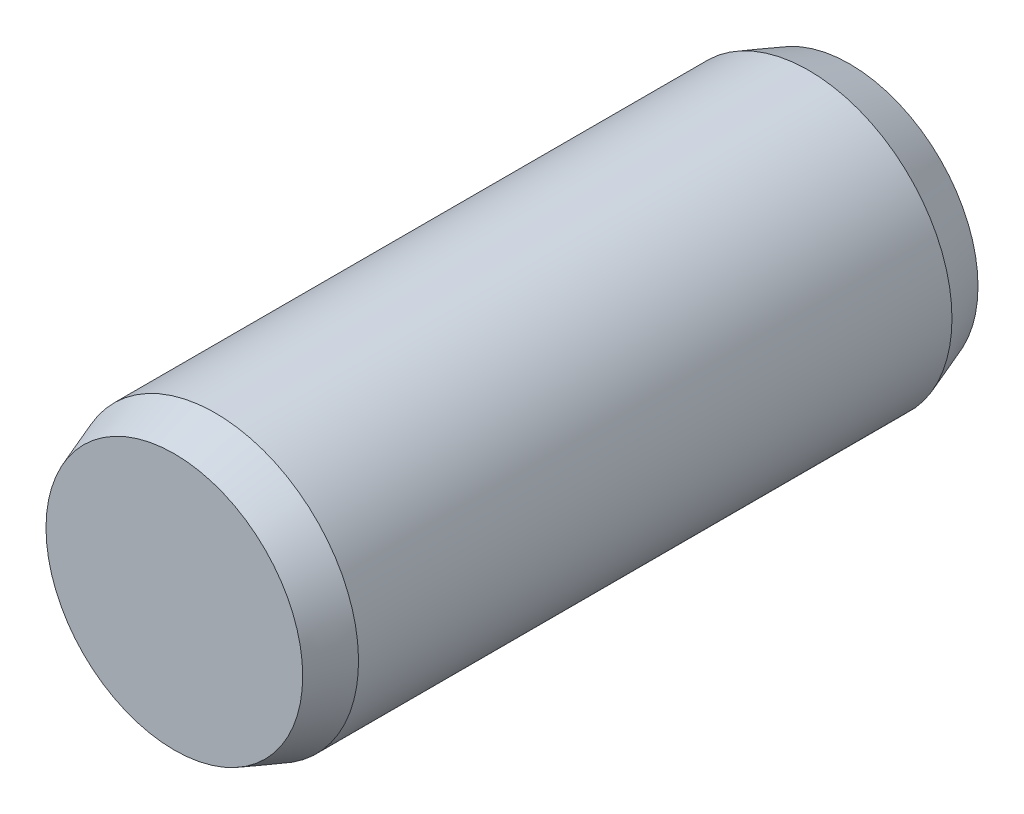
ISO-10303-21;
HEADER;
FILE_DESCRIPTION(('STEP AP214'),'2;1');
FILE_NAME('part.step','',(''),(''),'','','');
FILE_SCHEMA(('AUTOMOTIVE_DESIGN { 1 0 10303 214 1 1 1 1 }'));
ENDSEC;
DATA;
#1=APPLICATION_CONTEXT('core data for automotive mechanical design processes');
#2=APPLICATION_PROTOCOL_DEFINITION('international standard','automotive_design',2000,#1);
#3=PRODUCT_CONTEXT('',#1,'mechanical');
#4=PRODUCT('Part','Part','',(#3));
#5=PRODUCT_RELATED_PRODUCT_CATEGORY('part','',(#4));
#6=PRODUCT_DEFINITION_FORMATION('','',#4);
#7=PRODUCT_DEFINITION_CONTEXT('part definition',#1,'design');
#8=PRODUCT_DEFINITION('design','',#6,#7);
#9=PRODUCT_DEFINITION_SHAPE('','',#8);
#10=(LENGTH_UNIT() NAMED_UNIT(*) SI_UNIT(.MILLI.,.METRE.));
#11=(NAMED_UNIT(*) PLANE_ANGLE_UNIT() SI_UNIT($,.RADIAN.));
#12=(NAMED_UNIT(*) SI_UNIT($,.STERADIAN.) SOLID_ANGLE_UNIT());
#13=UNCERTAINTY_MEASURE_WITH_UNIT(LENGTH_MEASURE(1.E-05),#10,'distance_accuracy_value','');
#14=(GEOMETRIC_REPRESENTATION_CONTEXT(3) GLOBAL_UNCERTAINTY_ASSIGNED_CONTEXT((#13)) GLOBAL_UNIT_ASSIGNED_CONTEXT((#10,
#11,#12)) REPRESENTATION_CONTEXT('',''));
#15=CARTESIAN_POINT('',(0.,0.,0.));
#16=DIRECTION('',(0.,0.,1.));
#17=DIRECTION('',(1.,0.,0.));
#18=AXIS2_PLACEMENT_3D('',#15,#16,#17);
#19=CARTESIAN_POINT('',(0.,0.,7.9));
#20=DIRECTION('',(0.,0.,1.));
#21=DIRECTION('',(1.,0.,0.));
#22=AXIS2_PLACEMENT_3D('',#19,#20,#21);
#23=PLANE('',#22);
#24=CARTESIAN_POINT('',(-137.6913613,22.06128547,7.89999997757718));
#25=DIRECTION('',(0.,0.,-1.));
#26=DIRECTION('',(-1.,0.,0.));
#27=AXIS2_PLACEMENT_3D('',#24,#25,#26);
#28=CIRCLE('',#27,3.1360297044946);
#29=CARTESIAN_POINT('',(-140.827391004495,22.06128547,7.89999997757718));
#30=VERTEX_POINT('',#29);
#31=EDGE_CURVE('E17',#30,#30,#28,.F.);
#32=ORIENTED_EDGE('',*,*,#31,.T.);
#33=EDGE_LOOP('',(#32));
#34=FACE_BOUND('',#33,.T.);
#35=ADVANCED_FACE('F14',(#34),#23,.T.);
#36=CARTESIAN_POINT('',(0.,0.,-8.6));
#37=DIRECTION('',(0.,0.,-1.));
#38=DIRECTION('',(-1.,0.,0.));
#39=AXIS2_PLACEMENT_3D('',#36,#37,#38);
#40=PLANE('',#39);
#41=CARTESIAN_POINT('',(-137.6913613,22.06128547,-8.60000000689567));
#42=DIRECTION('',(0.,0.,1.));
#43=DIRECTION('',(1.,0.,0.));
#44=AXIS2_PLACEMENT_3D('',#41,#42,#43);
#45=CIRCLE('',#44,3.13602978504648);
#46=CARTESIAN_POINT('',(-134.555331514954,22.06128547,-8.60000000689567));
#47=VERTEX_POINT('',#46);
#48=EDGE_CURVE('E26',#47,#47,#45,.F.);
#49=ORIENTED_EDGE('',*,*,#48,.T.);
#50=EDGE_LOOP('',(#49));
#51=FACE_BOUND('',#50,.T.);
#52=ADVANCED_FACE('F38',(#51),#40,.T.);
#53=CARTESIAN_POINT('',(-137.6913613,22.06128547,7.9));
#54=DIRECTION('',(0.,0.,-1.));
#55=DIRECTION('',(-1.,0.,0.));
#56=AXIS2_PLACEMENT_3D('',#53,#54,#55);
#57=CONICAL_SURFACE('',#56,3.13602969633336,0.34906591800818);
#58=CARTESIAN_POINT('',(-137.6913613,22.06128547,6.9));
#59=DIRECTION('',(0.,0.,-1.));
#60=DIRECTION('',(-0.944950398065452,0.32721360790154,0.));
#61=AXIS2_PLACEMENT_3D('',#58,#59,#60);
#62=CIRCLE('',#61,3.50000000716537);
#63=CARTESIAN_POINT('',(-140.9986877,23.2065331,6.9));
#64=VERTEX_POINT('',#63);
#65=EDGE_CURVE('E21',#64,#64,#62,.F.);
#66=ORIENTED_EDGE('',*,*,#65,.T.);
#67=EDGE_LOOP('',(#66));
#68=FACE_BOUND('',#67,.T.);
#69=ORIENTED_EDGE('',*,*,#31,.F.);
#70=EDGE_LOOP('',(#69));
#71=FACE_BOUND('',#70,.T.);
#72=ADVANCED_FACE('F35',(#68,#71),#57,.T.);
#73=CARTESIAN_POINT('',(-137.6913613,22.06128547,-8.6));
#74=DIRECTION('',(0.,0.,1.));
#75=DIRECTION('',(1.,0.,0.));
#76=AXIS2_PLACEMENT_3D('',#73,#74,#75);
#77=CONICAL_SURFACE('',#76,3.13602978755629,0.349065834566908);
#78=CARTESIAN_POINT('',(-137.6913613,22.06128547,-7.6));
#79=DIRECTION('',(0.,0.,-1.));
#80=DIRECTION('',(-0.944950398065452,0.32721360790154,0.));
#81=AXIS2_PLACEMENT_3D('',#78,#79,#80);
#82=CIRCLE('',#81,3.50000000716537);
#83=CARTESIAN_POINT('',(-140.9986877,23.2065331,-7.6));
#84=VERTEX_POINT('',#83);
#85=EDGE_CURVE('E10',#84,#84,#82,.T.);
#86=ORIENTED_EDGE('',*,*,#85,.T.);
#87=EDGE_LOOP('',(#86));
#88=FACE_BOUND('',#87,.T.);
#89=ORIENTED_EDGE('',*,*,#48,.F.);
#90=EDGE_LOOP('',(#89));
#91=FACE_BOUND('',#90,.T.);
#92=ADVANCED_FACE('F37',(#88,#91),#77,.T.);
#93=CARTESIAN_POINT('',(-137.6913613,22.06128547,6.9));
#94=DIRECTION('',(0.,0.,-1.));
#95=DIRECTION('',(0.,1.,0.));
#96=AXIS2_PLACEMENT_3D('',#93,#94,#95);
#97=CYLINDRICAL_SURFACE('',#96,3.50000000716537);
#98=ORIENTED_EDGE('',*,*,#85,.F.);
#99=EDGE_LOOP('',(#98));
#100=FACE_BOUND('',#99,.T.);
#101=ORIENTED_EDGE('',*,*,#65,.F.);
#102=EDGE_LOOP('',(#101));
#103=FACE_BOUND('',#102,.T.);
#104=ADVANCED_FACE('F46',(#100,#103),#97,.T.);
#105=CLOSED_SHELL('',(#35,#52,#72,#92,#104));
#106=MANIFOLD_SOLID_BREP('B1',#105);
#107=ADVANCED_BREP_SHAPE_REPRESENTATION('',(#18,#106),#14);
#108=SHAPE_DEFINITION_REPRESENTATION(#9,#107);
ENDSEC;
END-ISO-10303-21;
